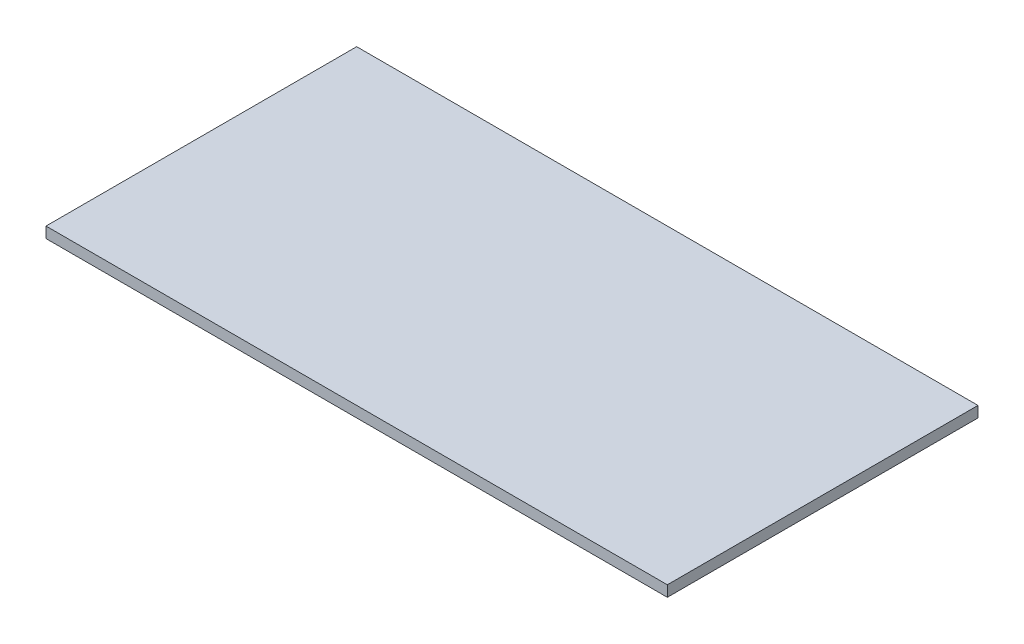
from build123d import *

# Parameters (mm, degrees)
ESQUISSE1_W                                    = 1600
ESQUISSE1_H                                    = 800
BOSS_EXTRU_1_DEPTH                             = 28
FRAISAGE_POUR_VIS_T_TE_FRAIS_E_M81_D           = 8
FRAISAGE_POUR_VIS_T_TE_FRAIS_E_M81_DEPTH       = 20
FRAISAGE_POUR_VIS_T_TE_FRAIS_E_M81_CSINK_D     = 13
FRAISAGE_POUR_VIS_T_TE_FRAIS_E_M81_CSINK_ANGLE = 90
FRAISAGE_POUR_VIS_T_TE_FRAIS_E_M81_TIP         = 2.403442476


with BuildPart() as part:
    # Esquisse1 → Boss.-Extru.1 (new body)
    with BuildSketch(Plane(origin=(0, 0, 0), x_dir=(1, 0, 0), z_dir=(0, 1, 0))):
        Rectangle(ESQUISSE1_W, ESQUISSE1_H)
    extrude(amount=BOSS_EXTRU_1_DEPTH)

    # Fraisage pour vis _ t_te frais_e M81
    with Locations(Plane(origin=(0, 0, 0), x_dir=(-1, 0, 0), z_dir=(0, -1, 0))):
        with Locations((750, -350), (750, -50), (650, -350), (650, -50), (650, 50), (650, 350), (750, 50), (750, 350), (-750, -350), (-750, -50), (-650, -50), (-650, -350), (-750, 50), (-750, 350), (-650, 350), (-650, 50)):
            CounterSinkHole(FRAISAGE_POUR_VIS_T_TE_FRAIS_E_M81_D / 2, FRAISAGE_POUR_VIS_T_TE_FRAIS_E_M81_CSINK_D / 2, depth=FRAISAGE_POUR_VIS_T_TE_FRAIS_E_M81_DEPTH, counter_sink_angle=FRAISAGE_POUR_VIS_T_TE_FRAIS_E_M81_CSINK_ANGLE)
            with Locations((0, 0, -(FRAISAGE_POUR_VIS_T_TE_FRAIS_E_M81_DEPTH + FRAISAGE_POUR_VIS_T_TE_FRAIS_E_M81_TIP / 2))):  # 118° drill point
                Cone(0, FRAISAGE_POUR_VIS_T_TE_FRAIS_E_M81_D / 2, FRAISAGE_POUR_VIS_T_TE_FRAIS_E_M81_TIP, mode=Mode.SUBTRACT)


solid = part.part
